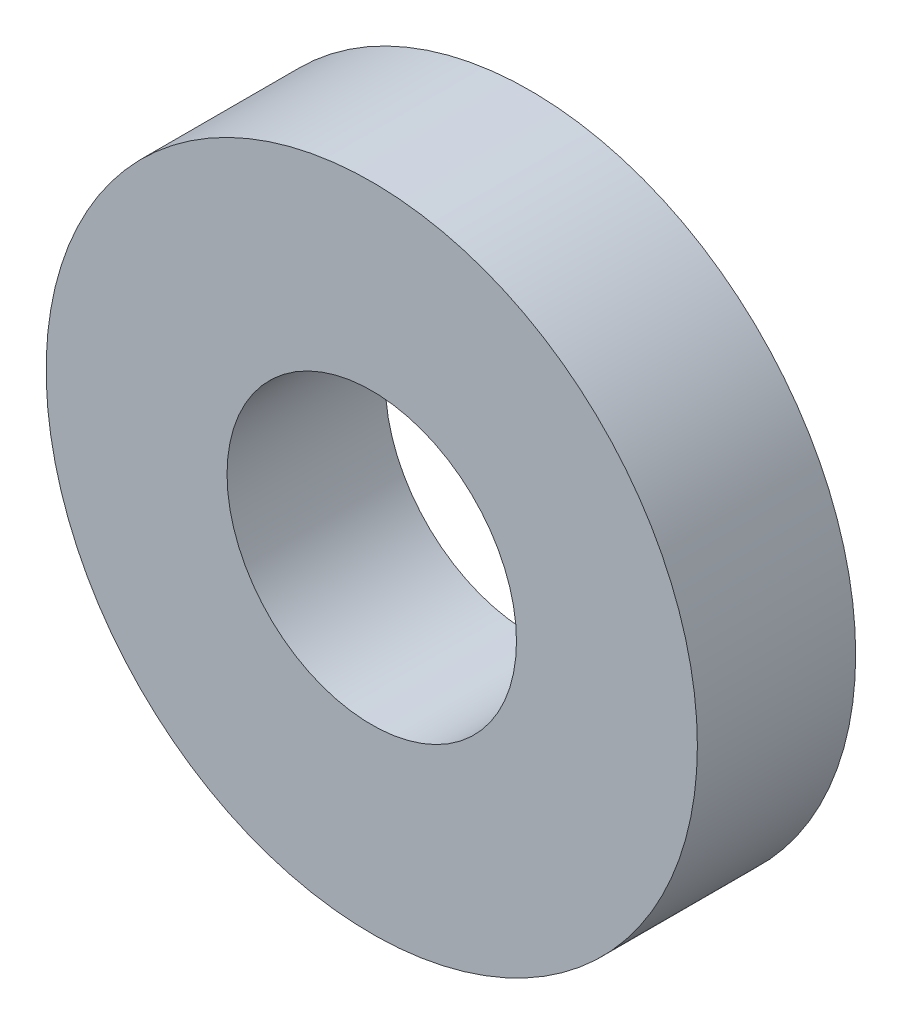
from build123d import *

# Parameters (mm, degrees)
SKETCH1_R           = 7.2
SKETCH1_R_2         = 3.2
BOSS_EXTRUDE1_DEPTH = 3.5


with BuildPart() as part:
    # Sketch1 → Boss-Extrude1 (new body)
    with BuildSketch(Plane.XY):
        Circle(SKETCH1_R)
        Circle(SKETCH1_R_2, mode=Mode.SUBTRACT)
    extrude(amount=BOSS_EXTRUDE1_DEPTH)


solid = part.part
